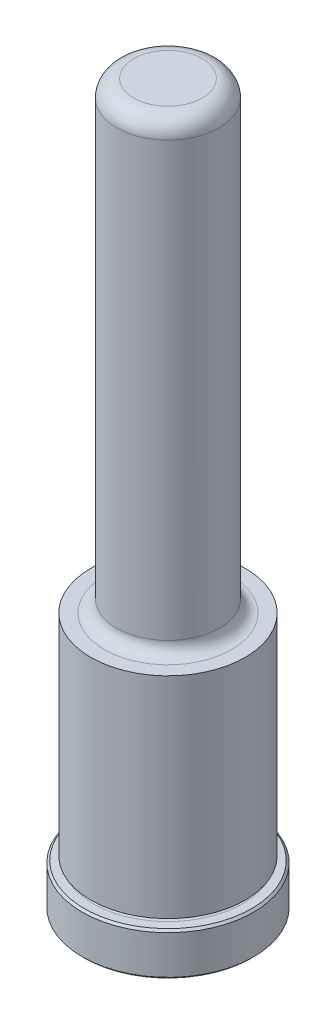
from build123d import *

# Parameters (mm, degrees)
CHAMFER1_SIZE = 0.381
FILLET1_R     = 3.175


with BuildPart() as part:
    # Sketch1 → Revolve1 (revolve)
    with BuildSketch(Plane(origin=(0, 0, 0), x_dir=(0, 0, -1), z_dir=(1, 0, 0)), mode=Mode.PRIVATE) as revolve1_sk:
        with BuildLine():
            Line((0, 0), (15.875, 0))
            Line((15.875, 0), (15.875, 7.9248))
            Line((15.875, 7.9248), (13.8938, 7.9248))
            ThreePointArc((13.8938, 7.9248), (13.5128, 8.3058), (13.8938, 8.6868))
            Line((13.8938, 8.6868), (14.3002, 8.6868))
            Line((14.3002, 8.6868), (14.3002, 47.625))
            Line((14.3002, 47.625), (11.7983, 47.625))
            ThreePointArc((11.7983, 47.625), (10.181853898, 48.294553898), (9.5123, 49.911))
            Line((9.5123, 49.911), (9.5123, 133.35))
            Line((9.5123, 133.35), (0, 133.35))
            Line((0, 133.35), (0, 0))
        make_face()
    revolve(revolve1_sk.sketch.rotate(Axis((0, 0, 0), (0, -1, 0)), 180), axis=Axis((0, 0, 0), (0, -1, 0)))

    # Chamfer1
    chamfer1_edges = [part.edges().sort_by_distance(p)[0] for p in [
        (0, 7.9248, -15.875),
        (0, 0, -15.875),
    ]]
    chamfer(chamfer1_edges, length=CHAMFER1_SIZE)

    # Fillet1
    fillet1_edges = [part.edges().sort_by_distance(p)[0] for p in [
        (0, 133.35, -9.5123),
    ]]
    fillet(fillet1_edges, radius=FILLET1_R)


solid = part.part
